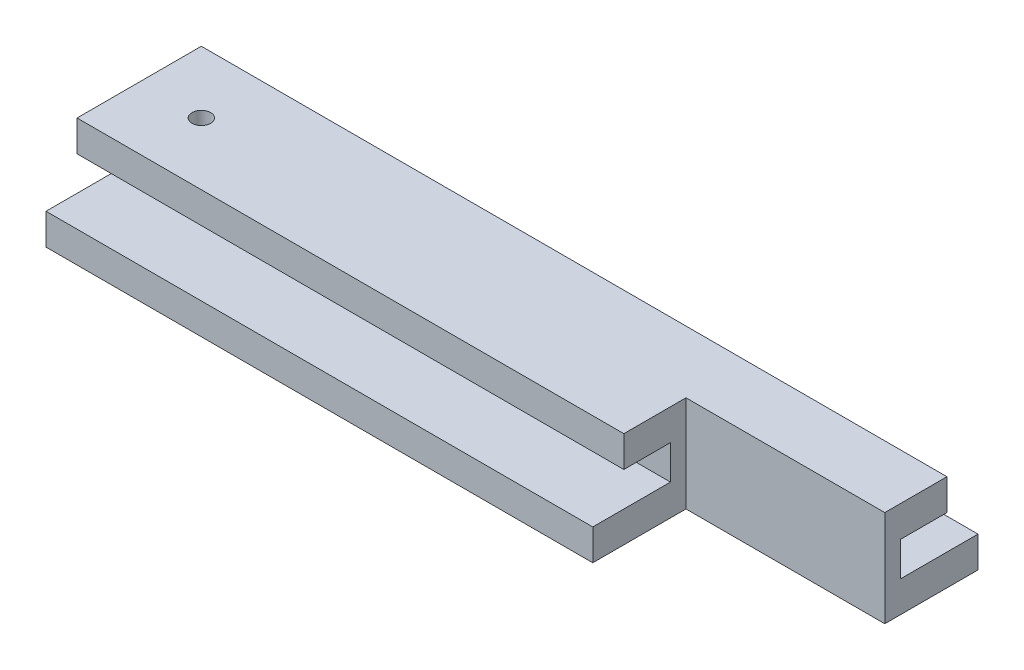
from build123d import *

# Parameters (mm, degrees)
SKETCH1_W           = 30
SKETCH1_H           = 5
BOSS_EXTRUDE1_DEPTH = 120
SKETCH2_W           = 120
SKETCH2_H           = 5
BOSS_EXTRUDE2_DEPTH = 10.5
SKETCH3_W           = 120
SKETCH3_H           = 5
BOSS_EXTRUDE3_DEPTH = 7.5
SKETCH4_W           = 120
SKETCH4_H           = 5
BOSS_EXTRUDE4_DEPTH = 7.5
SKETCH5_W           = 32
SKETCH5_H           = 15
CUT_EXTRUDE1_DEPTH  = 122.923131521
SKETCH6_R           = 1.5
CUT_EXTRUDE2_DEPTH  = 122.923131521


with BuildPart() as part:
    # Sketch1 → Boss-Extrude1 (new body)
    with BuildSketch(Plane(origin=(0, 0, 0), x_dir=(0, 0, -1), z_dir=(1, 0, 0))):
        Rectangle(SKETCH1_W, SKETCH1_H)
    extrude(amount=BOSS_EXTRUDE1_DEPTH)

    # Sketch2 → Boss-Extrude2 (add)
    with BuildSketch(Plane(origin=(0, 2.5, 0), x_dir=(1, 0, 0), z_dir=(0, 1, 0))):
        with Locations((60, 0)):
            Rectangle(SKETCH2_W, SKETCH2_H)
    extrude(amount=BOSS_EXTRUDE2_DEPTH)

    # Sketch3 → Boss-Extrude3 (add)
    with BuildSketch(Plane.XY.offset(2.5)):
        with Locations((60, 10.5)):
            Rectangle(SKETCH3_W, SKETCH3_H)
    extrude(amount=BOSS_EXTRUDE3_DEPTH)

    # Sketch4 → Boss-Extrude4 (add)
    with BuildSketch(Plane(origin=(0, 0, -2.5), x_dir=(-1, 0, 0), z_dir=(0, 0, -1))):
        with Locations((-60, 10.5)):
            Rectangle(SKETCH4_W, SKETCH4_H)
    extrude(amount=BOSS_EXTRUDE4_DEPTH)

    # Sketch5 → Cut-Extrude1 (cut, through all)
    with BuildSketch(Plane.XZ.offset(2.5)):
        with Locations((104, 7.5)):
            Rectangle(SKETCH5_W, SKETCH5_H)
    extrude(amount=-CUT_EXTRUDE1_DEPTH, mode=Mode.SUBTRACT)

    # Sketch6 → Cut-Extrude2 (cut, through all)
    with BuildSketch(Plane(origin=(0, 13, 0), x_dir=(1, 0, 0), z_dir=(0, 1, 0))):
        with Locations(Location((10, 0, 0), (0, 0, 270))):
            Circle(SKETCH6_R)
    extrude(amount=-CUT_EXTRUDE2_DEPTH, mode=Mode.SUBTRACT)


solid = part.part
